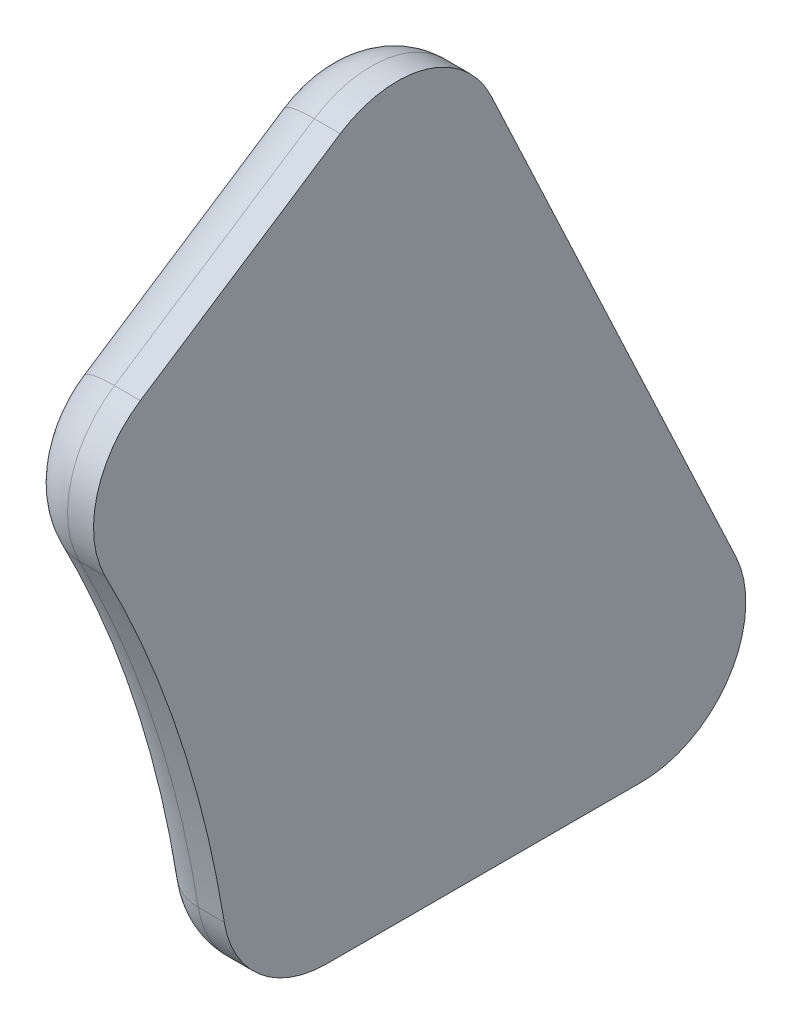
ISO-10303-21;
HEADER;
FILE_DESCRIPTION(('STEP AP214'),'2;1');
FILE_NAME('part.step','',(''),(''),'','','');
FILE_SCHEMA(('AUTOMOTIVE_DESIGN { 1 0 10303 214 1 1 1 1 }'));
ENDSEC;
DATA;
#1=APPLICATION_CONTEXT('core data for automotive mechanical design processes');
#2=APPLICATION_PROTOCOL_DEFINITION('international standard','automotive_design',2000,#1);
#3=PRODUCT_CONTEXT('',#1,'mechanical');
#4=PRODUCT('Part','Part','',(#3));
#5=PRODUCT_RELATED_PRODUCT_CATEGORY('part','',(#4));
#6=PRODUCT_DEFINITION_FORMATION('','',#4);
#7=PRODUCT_DEFINITION_CONTEXT('part definition',#1,'design');
#8=PRODUCT_DEFINITION('design','',#6,#7);
#9=PRODUCT_DEFINITION_SHAPE('','',#8);
#10=(LENGTH_UNIT() NAMED_UNIT(*) SI_UNIT(.MILLI.,.METRE.));
#11=(NAMED_UNIT(*) PLANE_ANGLE_UNIT() SI_UNIT($,.RADIAN.));
#12=(NAMED_UNIT(*) SI_UNIT($,.STERADIAN.) SOLID_ANGLE_UNIT());
#13=UNCERTAINTY_MEASURE_WITH_UNIT(LENGTH_MEASURE(1.E-05),#10,'distance_accuracy_value','');
#14=(GEOMETRIC_REPRESENTATION_CONTEXT(3) GLOBAL_UNCERTAINTY_ASSIGNED_CONTEXT((#13)) GLOBAL_UNIT_ASSIGNED_CONTEXT((#10,
#11,#12)) REPRESENTATION_CONTEXT('',''));
#15=CARTESIAN_POINT('',(0.,0.,0.));
#16=DIRECTION('',(0.,0.,1.));
#17=DIRECTION('',(1.,0.,0.));
#18=AXIS2_PLACEMENT_3D('',#15,#16,#17);
#19=CARTESIAN_POINT('',(15.,4896.09964976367,-12976.059631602));
#20=DIRECTION('',(-1.,0.,0.));
#21=DIRECTION('',(0.,0.,1.));
#22=AXIS2_PLACEMENT_3D('',#19,#20,#21);
#23=CYLINDRICAL_SURFACE('',#22,20.0000000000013);
#24=DIRECTION('',(-1.,0.,0.));
#25=VECTOR('',#24,1.);
#26=CARTESIAN_POINT('',(15.,4904.59832958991,-12994.1641183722));
#27=LINE('',#26,#25);
#28=CARTESIAN_POINT('',(15.,4904.59832958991,-12994.1641183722));
#29=VERTEX_POINT('',#28);
#30=CARTESIAN_POINT('',(10.,4904.59832958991,-12994.1641183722));
#31=VERTEX_POINT('',#30);
#32=EDGE_CURVE('E244',#29,#31,#27,.T.);
#33=ORIENTED_EDGE('',*,*,#32,.T.);
#34=CARTESIAN_POINT('',(10.,4896.09964976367,-12976.059631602));
#35=DIRECTION('',(1.,0.,0.));
#36=DIRECTION('',(0.,0.,-1.));
#37=AXIS2_PLACEMENT_3D('',#34,#35,#36);
#38=CIRCLE('',#37,20.0000000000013);
#39=CARTESIAN_POINT('',(10.,4912.82116595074,-12965.0873530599));
#40=VERTEX_POINT('',#39);
#41=EDGE_CURVE('E11',#31,#40,#38,.T.);
#42=ORIENTED_EDGE('',*,*,#41,.T.);
#43=DIRECTION('',(-1.,0.,0.));
#44=VECTOR('',#43,1.);
#45=CARTESIAN_POINT('',(15.,4912.82116595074,-12965.0873530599));
#46=LINE('',#45,#44);
#47=CARTESIAN_POINT('',(15.,4912.82116595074,-12965.0873530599));
#48=VERTEX_POINT('',#47);
#49=EDGE_CURVE('E132',#48,#40,#46,.T.);
#50=ORIENTED_EDGE('',*,*,#49,.F.);
#51=CARTESIAN_POINT('',(15.,4896.09964976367,-12976.059631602));
#52=DIRECTION('',(1.,0.,0.));
#53=DIRECTION('',(0.,0.,-1.));
#54=AXIS2_PLACEMENT_3D('',#51,#52,#53);
#55=CIRCLE('',#54,20.0000000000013);
#56=EDGE_CURVE('E139',#29,#48,#55,.T.);
#57=ORIENTED_EDGE('',*,*,#56,.F.);
#58=EDGE_LOOP('',(#33,#42,#50,#57));
#59=FACE_BOUND('',#58,.T.);
#60=ADVANCED_FACE('F35',(#59),#23,.T.);
#61=CARTESIAN_POINT('',(15.,4887.52205541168,-12926.532053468));
#62=DIRECTION('',(0.,-0.83607580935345,-0.548613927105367));
#63=DIRECTION('',(0.,0.548613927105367,-0.83607580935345));
#64=AXIS2_PLACEMENT_3D('',#61,#62,#63);
#65=PLANE('',#64);
#66=ORIENTED_EDGE('',*,*,#49,.T.);
#67=DIRECTION('',(0.,-0.548613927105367,0.83607580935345));
#68=VECTOR('',#67,1.);
#69=CARTESIAN_POINT('',(10.,4887.52205541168,-12926.532053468));
#70=LINE('',#69,#68);
#71=CARTESIAN_POINT('',(10.,4887.52205541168,-12926.532053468));
#72=VERTEX_POINT('',#71);
#73=EDGE_CURVE('E148',#40,#72,#70,.T.);
#74=ORIENTED_EDGE('',*,*,#73,.T.);
#75=DIRECTION('',(-1.,0.,0.));
#76=VECTOR('',#75,1.);
#77=CARTESIAN_POINT('',(15.,4887.52205541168,-12926.532053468));
#78=LINE('',#77,#76);
#79=CARTESIAN_POINT('',(15.,4887.52205541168,-12926.532053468));
#80=VERTEX_POINT('',#79);
#81=EDGE_CURVE('E135',#80,#72,#78,.T.);
#82=ORIENTED_EDGE('',*,*,#81,.F.);
#83=DIRECTION('',(0.,-0.548613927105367,0.83607580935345));
#84=VECTOR('',#83,1.);
#85=CARTESIAN_POINT('',(15.,4887.52205541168,-12926.532053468));
#86=LINE('',#85,#84);
#87=EDGE_CURVE('E127',#48,#80,#86,.T.);
#88=ORIENTED_EDGE('',*,*,#87,.F.);
#89=EDGE_LOOP('',(#66,#74,#82,#88));
#90=FACE_BOUND('',#89,.T.);
#91=ADVANCED_FACE('F129',(#90),#65,.F.);
#92=CARTESIAN_POINT('',(15.,4870.80053922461,-12937.5043320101));
#93=DIRECTION('',(-1.,0.,0.));
#94=DIRECTION('',(0.,0.,1.));
#95=AXIS2_PLACEMENT_3D('',#92,#93,#94);
#96=CYLINDRICAL_SURFACE('',#95,20.0000000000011);
#97=ORIENTED_EDGE('',*,*,#81,.T.);
#98=CARTESIAN_POINT('',(10.,4870.80053922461,-12937.5043320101));
#99=DIRECTION('',(1.,0.,0.));
#100=DIRECTION('',(0.,0.,-1.));
#101=AXIS2_PLACEMENT_3D('',#98,#99,#100);
#102=CIRCLE('',#101,20.0000000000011);
#103=CARTESIAN_POINT('',(10.,4861.5755539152,-12919.7589200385));
#104=VERTEX_POINT('',#103);
#105=EDGE_CURVE('E172',#72,#104,#102,.T.);
#106=ORIENTED_EDGE('',*,*,#105,.T.);
#107=DIRECTION('',(-1.,0.,0.));
#108=VECTOR('',#107,1.);
#109=CARTESIAN_POINT('',(15.,4861.5755539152,-12919.7589200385));
#110=LINE('',#109,#108);
#111=CARTESIAN_POINT('',(15.,4861.5755539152,-12919.7589200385));
#112=VERTEX_POINT('',#111);
#113=EDGE_CURVE('E152',#112,#104,#110,.T.);
#114=ORIENTED_EDGE('',*,*,#113,.F.);
#115=CARTESIAN_POINT('',(15.,4870.80053922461,-12937.5043320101));
#116=DIRECTION('',(1.,0.,0.));
#117=DIRECTION('',(0.,0.,-1.));
#118=AXIS2_PLACEMENT_3D('',#115,#116,#117);
#119=CIRCLE('',#118,20.0000000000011);
#120=EDGE_CURVE('E138',#80,#112,#119,.T.);
#121=ORIENTED_EDGE('',*,*,#120,.F.);
#122=EDGE_LOOP('',(#97,#106,#114,#121));
#123=FACE_BOUND('',#122,.T.);
#124=ADVANCED_FACE('F229',(#123),#96,.T.);
#125=CARTESIAN_POINT('',(15.,4755.48822285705,-12715.6866823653));
#126=DIRECTION('',(-1.,0.,0.));
#127=DIRECTION('',(0.,0.,1.));
#128=AXIS2_PLACEMENT_3D('',#125,#126,#127);
#129=CYLINDRICAL_SURFACE('',#128,229.999999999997);
#130=ORIENTED_EDGE('',*,*,#113,.T.);
#131=CARTESIAN_POINT('',(10.,4755.48822285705,-12715.6866823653));
#132=DIRECTION('',(1.,0.,0.));
#133=DIRECTION('',(0.,0.,-1.));
#134=AXIS2_PLACEMENT_3D('',#131,#132,#133);
#135=CIRCLE('',#134,229.999999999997);
#136=CARTESIAN_POINT('',(10.,4792.28822285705,-12942.7235956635));
#137=VERTEX_POINT('',#136);
#138=EDGE_CURVE('E174',#104,#137,#135,.F.);
#139=ORIENTED_EDGE('',*,*,#138,.T.);
#140=DIRECTION('',(-1.,0.,0.));
#141=VECTOR('',#140,1.);
#142=CARTESIAN_POINT('',(15.,4792.28822285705,-12942.7235956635));
#143=LINE('',#142,#141);
#144=CARTESIAN_POINT('',(15.,4792.28822285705,-12942.7235956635));
#145=VERTEX_POINT('',#144);
#146=EDGE_CURVE('E253',#145,#137,#143,.T.);
#147=ORIENTED_EDGE('',*,*,#146,.F.);
#148=CARTESIAN_POINT('',(15.,4755.48822285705,-12715.6866823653));
#149=DIRECTION('',(-1.,0.,0.));
#150=DIRECTION('',(0.,0.,-1.));
#151=AXIS2_PLACEMENT_3D('',#148,#149,#150);
#152=CIRCLE('',#151,229.999999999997);
#153=EDGE_CURVE('E233',#112,#145,#152,.T.);
#154=ORIENTED_EDGE('',*,*,#153,.F.);
#155=EDGE_LOOP('',(#130,#139,#147,#154));
#156=FACE_BOUND('',#155,.T.);
#157=ADVANCED_FACE('F257',(#156),#129,.F.);
#158=CARTESIAN_POINT('',(15.,4795.48822285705,-12962.4659359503));
#159=DIRECTION('',(-1.,0.,0.));
#160=DIRECTION('',(0.,0.,1.));
#161=AXIS2_PLACEMENT_3D('',#158,#159,#160);
#162=CYLINDRICAL_SURFACE('',#161,19.9999999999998);
#163=ORIENTED_EDGE('',*,*,#146,.T.);
#164=CARTESIAN_POINT('',(10.,4795.48822285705,-12962.4659359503));
#165=DIRECTION('',(1.,0.,0.));
#166=DIRECTION('',(0.,0.,-1.));
#167=AXIS2_PLACEMENT_3D('',#164,#165,#166);
#168=CIRCLE('',#167,19.9999999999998);
#169=CARTESIAN_POINT('',(10.,4775.48822285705,-12962.4659359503));
#170=VERTEX_POINT('',#169);
#171=EDGE_CURVE('E176',#137,#170,#168,.T.);
#172=ORIENTED_EDGE('',*,*,#171,.T.);
#173=DIRECTION('',(-1.,0.,0.));
#174=VECTOR('',#173,1.);
#175=CARTESIAN_POINT('',(15.,4775.48822285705,-12962.4659359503));
#176=LINE('',#175,#174);
#177=CARTESIAN_POINT('',(15.,4775.48822285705,-12962.4659359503));
#178=VERTEX_POINT('',#177);
#179=EDGE_CURVE('E250',#178,#170,#176,.T.);
#180=ORIENTED_EDGE('',*,*,#179,.F.);
#181=CARTESIAN_POINT('',(15.,4795.48822285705,-12962.4659359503));
#182=DIRECTION('',(1.,0.,0.));
#183=DIRECTION('',(0.,0.,-1.));
#184=AXIS2_PLACEMENT_3D('',#181,#182,#183);
#185=CIRCLE('',#184,19.9999999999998);
#186=EDGE_CURVE('E235',#145,#178,#185,.T.);
#187=ORIENTED_EDGE('',*,*,#186,.F.);
#188=EDGE_LOOP('',(#163,#172,#180,#187));
#189=FACE_BOUND('',#188,.T.);
#190=ADVANCED_FACE('F285',(#189),#162,.T.);
#191=CARTESIAN_POINT('',(15.,4775.48822285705,-12962.4659359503));
#192=DIRECTION('',(0.,1.,0.));
#193=DIRECTION('',(0.,0.,1.));
#194=AXIS2_PLACEMENT_3D('',#191,#192,#193);
#195=PLANE('',#194);
#196=ORIENTED_EDGE('',*,*,#179,.T.);
#197=DIRECTION('',(0.,0.,-1.));
#198=VECTOR('',#197,1.);
#199=CARTESIAN_POINT('',(10.,4775.48822285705,-12962.4659359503));
#200=LINE('',#199,#198);
#201=CARTESIAN_POINT('',(10.,4775.48822285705,-13023.2890457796));
#202=VERTEX_POINT('',#201);
#203=EDGE_CURVE('E178',#170,#202,#200,.T.);
#204=ORIENTED_EDGE('',*,*,#203,.T.);
#205=DIRECTION('',(-1.,0.,0.));
#206=VECTOR('',#205,1.);
#207=CARTESIAN_POINT('',(15.,4775.48822285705,-13023.2890457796));
#208=LINE('',#207,#206);
#209=CARTESIAN_POINT('',(15.,4775.48822285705,-13023.2890457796));
#210=VERTEX_POINT('',#209);
#211=EDGE_CURVE('E248',#210,#202,#208,.T.);
#212=ORIENTED_EDGE('',*,*,#211,.F.);
#213=DIRECTION('',(0.,0.,-1.));
#214=VECTOR('',#213,1.);
#215=CARTESIAN_POINT('',(15.,4775.48822285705,-12962.4659359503));
#216=LINE('',#215,#214);
#217=EDGE_CURVE('E239',#178,#210,#216,.T.);
#218=ORIENTED_EDGE('',*,*,#217,.F.);
#219=EDGE_LOOP('',(#196,#204,#212,#218));
#220=FACE_BOUND('',#219,.T.);
#221=ADVANCED_FACE('F288',(#220),#195,.F.);
#222=CARTESIAN_POINT('',(15.,4795.48822285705,-13023.2890457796));
#223=DIRECTION('',(-1.,0.,0.));
#224=DIRECTION('',(0.,0.,1.));
#225=AXIS2_PLACEMENT_3D('',#222,#223,#224);
#226=CYLINDRICAL_SURFACE('',#225,20.0000000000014);
#227=ORIENTED_EDGE('',*,*,#211,.T.);
#228=CARTESIAN_POINT('',(10.,4795.48822285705,-13023.2890457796));
#229=DIRECTION('',(1.,0.,0.));
#230=DIRECTION('',(0.,0.,-1.));
#231=AXIS2_PLACEMENT_3D('',#228,#229,#230);
#232=CIRCLE('',#231,20.0000000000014);
#233=CARTESIAN_POINT('',(10.,4803.98690268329,-13041.3935325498));
#234=VERTEX_POINT('',#233);
#235=EDGE_CURVE('E59',#202,#234,#232,.T.);
#236=ORIENTED_EDGE('',*,*,#235,.T.);
#237=DIRECTION('',(-1.,0.,0.));
#238=VECTOR('',#237,1.);
#239=CARTESIAN_POINT('',(15.,4803.98690268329,-13041.3935325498));
#240=LINE('',#239,#238);
#241=CARTESIAN_POINT('',(15.,4803.98690268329,-13041.3935325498));
#242=VERTEX_POINT('',#241);
#243=EDGE_CURVE('E246',#242,#234,#240,.T.);
#244=ORIENTED_EDGE('',*,*,#243,.F.);
#245=CARTESIAN_POINT('',(15.,4795.48822285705,-13023.2890457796));
#246=DIRECTION('',(1.,0.,0.));
#247=DIRECTION('',(0.,0.,-1.));
#248=AXIS2_PLACEMENT_3D('',#245,#246,#247);
#249=CIRCLE('',#248,20.0000000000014);
#250=EDGE_CURVE('E241',#210,#242,#249,.T.);
#251=ORIENTED_EDGE('',*,*,#250,.F.);
#252=EDGE_LOOP('',(#227,#236,#244,#251));
#253=FACE_BOUND('',#252,.T.);
#254=ADVANCED_FACE('F292',(#253),#226,.T.);
#255=CARTESIAN_POINT('',(15.,4904.59832958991,-12994.1641183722));
#256=DIRECTION('',(0.,-0.424933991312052,0.9052243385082));
#257=DIRECTION('',(0.,-0.9052243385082,-0.424933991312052));
#258=AXIS2_PLACEMENT_3D('',#255,#256,#257);
#259=PLANE('',#258);
#260=ORIENTED_EDGE('',*,*,#243,.T.);
#261=DIRECTION('',(0.,0.9052243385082,0.424933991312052));
#262=VECTOR('',#261,1.);
#263=CARTESIAN_POINT('',(10.,4904.59832958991,-12994.1641183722));
#264=LINE('',#263,#262);
#265=EDGE_CURVE('E44',#234,#31,#264,.T.);
#266=ORIENTED_EDGE('',*,*,#265,.T.);
#267=ORIENTED_EDGE('',*,*,#32,.F.);
#268=DIRECTION('',(0.,0.9052243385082,0.424933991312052));
#269=VECTOR('',#268,1.);
#270=CARTESIAN_POINT('',(15.,4904.59832958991,-12994.1641183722));
#271=LINE('',#270,#269);
#272=EDGE_CURVE('E144',#242,#29,#271,.T.);
#273=ORIENTED_EDGE('',*,*,#272,.F.);
#274=EDGE_LOOP('',(#260,#266,#267,#273));
#275=FACE_BOUND('',#274,.T.);
#276=ADVANCED_FACE('F296',(#275),#259,.F.);
#277=CARTESIAN_POINT('',(15.,4896.09964976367,-12976.059631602));
#278=DIRECTION('',(1.,0.,0.));
#279=DIRECTION('',(0.,0.,-1.));
#280=AXIS2_PLACEMENT_3D('',#277,#278,#279);
#281=PLANE('',#280);
#282=ORIENTED_EDGE('',*,*,#56,.T.);
#283=ORIENTED_EDGE('',*,*,#87,.T.);
#284=ORIENTED_EDGE('',*,*,#120,.T.);
#285=ORIENTED_EDGE('',*,*,#153,.T.);
#286=ORIENTED_EDGE('',*,*,#186,.T.);
#287=ORIENTED_EDGE('',*,*,#217,.T.);
#288=ORIENTED_EDGE('',*,*,#250,.T.);
#289=ORIENTED_EDGE('',*,*,#272,.T.);
#290=EDGE_LOOP('',(#282,#283,#284,#285,#286,#287,#288,#289));
#291=FACE_BOUND('',#290,.T.);
#292=ADVANCED_FACE('F142',(#291),#281,.T.);
#293=CARTESIAN_POINT('',(0.,4896.09964976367,-12976.059631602));
#294=DIRECTION('',(1.,0.,0.));
#295=DIRECTION('',(0.,0.,-1.));
#296=AXIS2_PLACEMENT_3D('',#293,#294,#295);
#297=PLANE('',#296);
#298=CARTESIAN_POINT('',(0.,4870.80053922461,-12937.5043320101));
#299=DIRECTION('',(1.,0.,0.));
#300=DIRECTION('',(0.,0.,-1.));
#301=AXIS2_PLACEMENT_3D('',#298,#299,#300);
#302=CIRCLE('',#301,10.0000000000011);
#303=CARTESIAN_POINT('',(0.,4866.18804656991,-12928.6316260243));
#304=VERTEX_POINT('',#303);
#305=CARTESIAN_POINT('',(0.,4879.16129731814,-12932.018192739));
#306=VERTEX_POINT('',#305);
#307=EDGE_CURVE('E167',#304,#306,#302,.F.);
#308=ORIENTED_EDGE('',*,*,#307,.T.);
#309=DIRECTION('',(0.,-0.548613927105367,0.83607580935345));
#310=VECTOR('',#309,1.);
#311=CARTESIAN_POINT('',(0.,4904.4604078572,-12970.573492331));
#312=LINE('',#311,#310);
#313=CARTESIAN_POINT('',(0.,4904.4604078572,-12970.573492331));
#314=VERTEX_POINT('',#313);
#315=EDGE_CURVE('E169',#306,#314,#312,.F.);
#316=ORIENTED_EDGE('',*,*,#315,.T.);
#317=CARTESIAN_POINT('',(0.,4896.09964976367,-12976.059631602));
#318=DIRECTION('',(1.,0.,0.));
#319=DIRECTION('',(0.,0.,-1.));
#320=AXIS2_PLACEMENT_3D('',#317,#318,#319);
#321=CIRCLE('',#320,10.0000000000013);
#322=CARTESIAN_POINT('',(0.,4900.34898967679,-12985.1118749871));
#323=VERTEX_POINT('',#322);
#324=EDGE_CURVE('E150',#314,#323,#321,.F.);
#325=ORIENTED_EDGE('',*,*,#324,.T.);
#326=DIRECTION('',(0.,0.9052243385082,0.424933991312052));
#327=VECTOR('',#326,1.);
#328=CARTESIAN_POINT('',(0.,4900.34898967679,-12985.1118749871));
#329=LINE('',#328,#327);
#330=CARTESIAN_POINT('',(0.,4799.73756277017,-13032.3412891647));
#331=VERTEX_POINT('',#330);
#332=EDGE_CURVE('E157',#323,#331,#329,.F.);
#333=ORIENTED_EDGE('',*,*,#332,.T.);
#334=CARTESIAN_POINT('',(0.,4795.48822285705,-13023.2890457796));
#335=DIRECTION('',(1.,0.,0.));
#336=DIRECTION('',(0.,0.,-1.));
#337=AXIS2_PLACEMENT_3D('',#334,#335,#336);
#338=CIRCLE('',#337,10.0000000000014);
#339=CARTESIAN_POINT('',(0.,4785.48822285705,-13023.2890457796));
#340=VERTEX_POINT('',#339);
#341=EDGE_CURVE('E159',#331,#340,#338,.F.);
#342=ORIENTED_EDGE('',*,*,#341,.T.);
#343=DIRECTION('',(0.,0.,-1.));
#344=VECTOR('',#343,1.);
#345=CARTESIAN_POINT('',(0.,4785.48822285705,-12976.059631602));
#346=LINE('',#345,#344);
#347=CARTESIAN_POINT('',(0.,4785.48822285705,-12962.4659359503));
#348=VERTEX_POINT('',#347);
#349=EDGE_CURVE('E161',#340,#348,#346,.F.);
#350=ORIENTED_EDGE('',*,*,#349,.T.);
#351=CARTESIAN_POINT('',(0.,4795.48822285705,-12962.4659359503));
#352=DIRECTION('',(1.,0.,0.));
#353=DIRECTION('',(0.,0.,-1.));
#354=AXIS2_PLACEMENT_3D('',#351,#352,#353);
#355=CIRCLE('',#354,9.99999999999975);
#356=CARTESIAN_POINT('',(0.,4793.88822285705,-12952.5947658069));
#357=VERTEX_POINT('',#356);
#358=EDGE_CURVE('E163',#348,#357,#355,.F.);
#359=ORIENTED_EDGE('',*,*,#358,.T.);
#360=CARTESIAN_POINT('',(0.,4755.48822285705,-12715.6866823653));
#361=DIRECTION('',(1.,0.,0.));
#362=DIRECTION('',(0.,0.,-1.));
#363=AXIS2_PLACEMENT_3D('',#360,#361,#362);
#364=CIRCLE('',#363,239.999999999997);
#365=EDGE_CURVE('E165',#357,#304,#364,.T.);
#366=ORIENTED_EDGE('',*,*,#365,.T.);
#367=EDGE_LOOP('',(#308,#316,#325,#333,#342,#350,#359,#366));
#368=FACE_BOUND('',#367,.T.);
#369=ADVANCED_FACE('F213',(#368),#297,.F.);
#370=CARTESIAN_POINT('',(10.,4785.48822285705,-12962.4659359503));
#371=DIRECTION('',(0.,0.,-1.));
#372=DIRECTION('',(0.,1.,0.));
#373=AXIS2_PLACEMENT_3D('',#370,#371,#372);
#374=CYLINDRICAL_SURFACE('',#373,10.);
#375=CARTESIAN_POINT('',(10.,4785.48822285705,-12962.4659359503));
#376=DIRECTION('',(0.,0.,1.));
#377=DIRECTION('',(1.,0.,0.));
#378=AXIS2_PLACEMENT_3D('',#375,#376,#377);
#379=CIRCLE('',#378,10.);
#380=EDGE_CURVE('E197',#348,#170,#379,.T.);
#381=ORIENTED_EDGE('',*,*,#380,.F.);
#382=ORIENTED_EDGE('',*,*,#349,.F.);
#383=CARTESIAN_POINT('',(10.,4785.48822285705,-13023.2890457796));
#384=DIRECTION('',(0.,0.,-1.));
#385=DIRECTION('',(-1.,0.,0.));
#386=AXIS2_PLACEMENT_3D('',#383,#384,#385);
#387=CIRCLE('',#386,10.);
#388=EDGE_CURVE('E39',#202,#340,#387,.T.);
#389=ORIENTED_EDGE('',*,*,#388,.F.);
#390=ORIENTED_EDGE('',*,*,#203,.F.);
#391=EDGE_LOOP('',(#381,#382,#389,#390));
#392=FACE_BOUND('',#391,.T.);
#393=ADVANCED_FACE('F37',(#392),#374,.T.);
#394=CARTESIAN_POINT('',(10.,4795.48822285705,-13023.2890457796));
#395=DIRECTION('',(1.,0.,0.));
#396=DIRECTION('',(0.,0.,-1.));
#397=AXIS2_PLACEMENT_3D('',#394,#395,#396);
#398=TOROIDAL_SURFACE('',#397,10.0000000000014,10.);
#399=ORIENTED_EDGE('',*,*,#388,.T.);
#400=ORIENTED_EDGE('',*,*,#341,.F.);
#401=CARTESIAN_POINT('',(10.,4799.73756277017,-13032.3412891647));
#402=DIRECTION('',(0.,0.905224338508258,0.424933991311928));
#403=DIRECTION('',(0.,-0.424933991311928,0.905224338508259));
#404=AXIS2_PLACEMENT_3D('',#401,#402,#403);
#405=CIRCLE('',#404,10.);
#406=EDGE_CURVE('E195',#234,#331,#405,.T.);
#407=ORIENTED_EDGE('',*,*,#406,.F.);
#408=ORIENTED_EDGE('',*,*,#235,.F.);
#409=EDGE_LOOP('',(#399,#400,#407,#408));
#410=FACE_BOUND('',#409,.T.);
#411=ADVANCED_FACE('F207',(#410),#398,.T.);
#412=CARTESIAN_POINT('',(10.,4795.48822285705,-12962.4659359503));
#413=DIRECTION('',(1.,0.,0.));
#414=DIRECTION('',(0.,0.,-1.));
#415=AXIS2_PLACEMENT_3D('',#412,#413,#414);
#416=DEGENERATE_TOROIDAL_SURFACE('',#415,9.99999999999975,10.,.T.);
#417=ORIENTED_EDGE('',*,*,#380,.T.);
#418=ORIENTED_EDGE('',*,*,#171,.F.);
#419=CARTESIAN_POINT('',(10.,4793.88822285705,-12952.5947658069));
#420=DIRECTION('',(0.,0.987117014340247,0.15999999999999));
#421=DIRECTION('',(0.,-0.15999999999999,0.987117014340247));
#422=AXIS2_PLACEMENT_3D('',#419,#420,#421);
#423=CIRCLE('',#422,10.);
#424=EDGE_CURVE('E192',#357,#137,#423,.T.);
#425=ORIENTED_EDGE('',*,*,#424,.F.);
#426=ORIENTED_EDGE('',*,*,#358,.F.);
#427=EDGE_LOOP('',(#417,#418,#425,#426));
#428=FACE_BOUND('',#427,.T.);
#429=ADVANCED_FACE('F321',(#428),#416,.T.);
#430=CARTESIAN_POINT('',(10.,4900.34898967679,-12985.1118749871));
#431=DIRECTION('',(0.,0.9052243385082,0.424933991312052));
#432=DIRECTION('',(0.,-0.424933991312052,0.9052243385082));
#433=AXIS2_PLACEMENT_3D('',#430,#431,#432);
#434=CYLINDRICAL_SURFACE('',#433,10.);
#435=ORIENTED_EDGE('',*,*,#406,.T.);
#436=ORIENTED_EDGE('',*,*,#332,.F.);
#437=CARTESIAN_POINT('',(10.,4900.34898967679,-12985.1118749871));
#438=DIRECTION('',(0.,0.905224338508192,0.424933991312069));
#439=DIRECTION('',(0.,-0.424933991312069,0.905224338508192));
#440=AXIS2_PLACEMENT_3D('',#437,#438,#439);
#441=CIRCLE('',#440,10.);
#442=EDGE_CURVE('E189',#31,#323,#441,.T.);
#443=ORIENTED_EDGE('',*,*,#442,.F.);
#444=ORIENTED_EDGE('',*,*,#265,.F.);
#445=EDGE_LOOP('',(#435,#436,#443,#444));
#446=FACE_BOUND('',#445,.T.);
#447=ADVANCED_FACE('F219',(#446),#434,.T.);
#448=CARTESIAN_POINT('',(10.,4755.48822285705,-12715.6866823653));
#449=DIRECTION('',(1.,0.,0.));
#450=DIRECTION('',(0.,0.,-1.));
#451=AXIS2_PLACEMENT_3D('',#448,#449,#450);
#452=TOROIDAL_SURFACE('',#451,239.999999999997,10.);
#453=ORIENTED_EDGE('',*,*,#424,.T.);
#454=ORIENTED_EDGE('',*,*,#138,.F.);
#455=CARTESIAN_POINT('',(10.,4866.18804656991,-12928.6316260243));
#456=DIRECTION('',(0.,0.887270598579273,0.461249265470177));
#457=DIRECTION('',(0.,-0.461249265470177,0.887270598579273));
#458=AXIS2_PLACEMENT_3D('',#455,#456,#457);
#459=CIRCLE('',#458,10.);
#460=EDGE_CURVE('E186',#304,#104,#459,.T.);
#461=ORIENTED_EDGE('',*,*,#460,.F.);
#462=ORIENTED_EDGE('',*,*,#365,.F.);
#463=EDGE_LOOP('',(#453,#454,#461,#462));
#464=FACE_BOUND('',#463,.T.);
#465=ADVANCED_FACE('F261',(#464),#452,.T.);
#466=CARTESIAN_POINT('',(10.,4896.09964976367,-12976.059631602));
#467=DIRECTION('',(1.,0.,0.));
#468=DIRECTION('',(0.,0.,-1.));
#469=AXIS2_PLACEMENT_3D('',#466,#467,#468);
#470=TOROIDAL_SURFACE('',#469,10.0000000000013,10.);
#471=ORIENTED_EDGE('',*,*,#442,.T.);
#472=ORIENTED_EDGE('',*,*,#324,.F.);
#473=CARTESIAN_POINT('',(10.,4904.46040785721,-12970.573492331));
#474=DIRECTION('',(0.,-0.548613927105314,0.836075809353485));
#475=DIRECTION('',(0.,-0.836075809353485,-0.548613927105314));
#476=AXIS2_PLACEMENT_3D('',#473,#474,#475);
#477=CIRCLE('',#476,10.);
#478=EDGE_CURVE('E184',#40,#314,#477,.T.);
#479=ORIENTED_EDGE('',*,*,#478,.F.);
#480=ORIENTED_EDGE('',*,*,#41,.F.);
#481=EDGE_LOOP('',(#471,#472,#479,#480));
#482=FACE_BOUND('',#481,.T.);
#483=ADVANCED_FACE('F221',(#482),#470,.T.);
#484=CARTESIAN_POINT('',(10.,4870.80053922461,-12937.5043320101));
#485=DIRECTION('',(1.,0.,0.));
#486=DIRECTION('',(0.,0.,-1.));
#487=AXIS2_PLACEMENT_3D('',#484,#485,#486);
#488=TOROIDAL_SURFACE('',#487,10.0000000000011,10.);
#489=ORIENTED_EDGE('',*,*,#460,.T.);
#490=ORIENTED_EDGE('',*,*,#105,.F.);
#491=CARTESIAN_POINT('',(10.,4879.16129731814,-12932.018192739));
#492=DIRECTION('',(0.,0.548613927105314,-0.836075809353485));
#493=DIRECTION('',(0.,0.836075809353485,0.548613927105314));
#494=AXIS2_PLACEMENT_3D('',#491,#492,#493);
#495=CIRCLE('',#494,10.);
#496=EDGE_CURVE('E182',#306,#72,#495,.T.);
#497=ORIENTED_EDGE('',*,*,#496,.F.);
#498=ORIENTED_EDGE('',*,*,#307,.F.);
#499=EDGE_LOOP('',(#489,#490,#497,#498));
#500=FACE_BOUND('',#499,.T.);
#501=ADVANCED_FACE('F265',(#500),#488,.T.);
#502=CARTESIAN_POINT('',(10.,4879.16129731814,-12932.018192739));
#503=DIRECTION('',(0.,-0.548613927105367,0.83607580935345));
#504=DIRECTION('',(0.,-0.83607580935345,-0.548613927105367));
#505=AXIS2_PLACEMENT_3D('',#502,#503,#504);
#506=CYLINDRICAL_SURFACE('',#505,10.);
#507=ORIENTED_EDGE('',*,*,#478,.T.);
#508=ORIENTED_EDGE('',*,*,#315,.F.);
#509=ORIENTED_EDGE('',*,*,#496,.T.);
#510=ORIENTED_EDGE('',*,*,#73,.F.);
#511=EDGE_LOOP('',(#507,#508,#509,#510));
#512=FACE_BOUND('',#511,.T.);
#513=ADVANCED_FACE('F225',(#512),#506,.T.);
#514=CLOSED_SHELL('',(#60,#91,#124,#157,#190,#221,#254,#276,#292,#369,#393,#411,#429,#447,#465,
#483,#501,#513));
#515=MANIFOLD_SOLID_BREP('B2',#514);
#516=ADVANCED_BREP_SHAPE_REPRESENTATION('',(#18,#515),#14);
#517=SHAPE_DEFINITION_REPRESENTATION(#9,#516);
ENDSEC;
END-ISO-10303-21;
